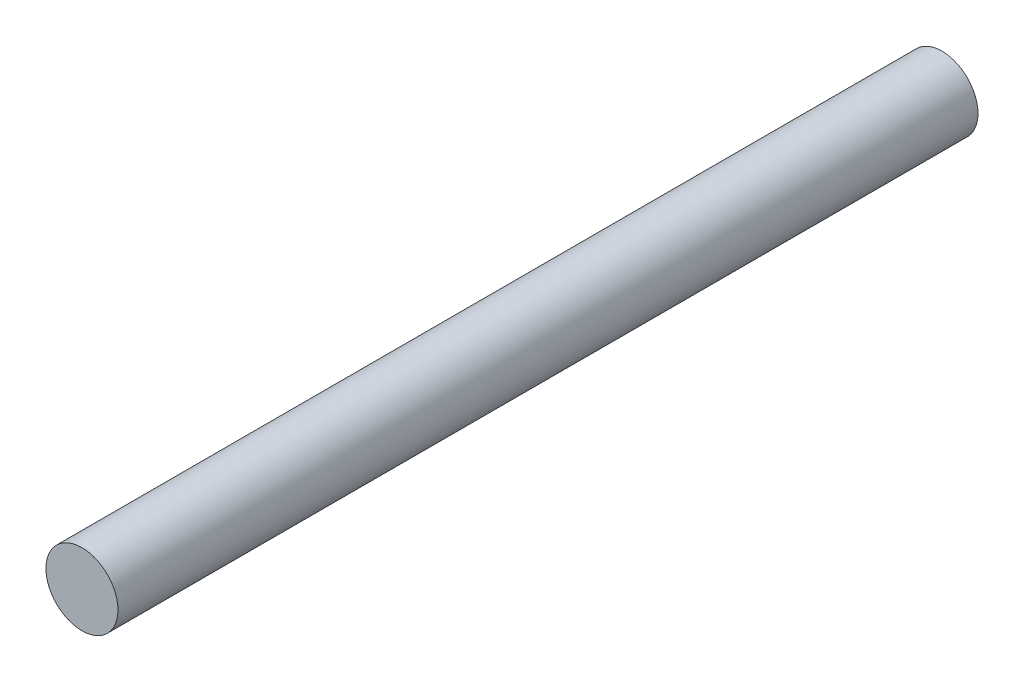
ISO-10303-21;
HEADER;
FILE_DESCRIPTION(('STEP AP214'),'2;1');
FILE_NAME('part.step','',(''),(''),'','','');
FILE_SCHEMA(('AUTOMOTIVE_DESIGN { 1 0 10303 214 1 1 1 1 }'));
ENDSEC;
DATA;
#1=APPLICATION_CONTEXT('core data for automotive mechanical design processes');
#2=APPLICATION_PROTOCOL_DEFINITION('international standard','automotive_design',2000,#1);
#3=PRODUCT_CONTEXT('',#1,'mechanical');
#4=PRODUCT('Part','Part','',(#3));
#5=PRODUCT_RELATED_PRODUCT_CATEGORY('part','',(#4));
#6=PRODUCT_DEFINITION_FORMATION('','',#4);
#7=PRODUCT_DEFINITION_CONTEXT('part definition',#1,'design');
#8=PRODUCT_DEFINITION('design','',#6,#7);
#9=PRODUCT_DEFINITION_SHAPE('','',#8);
#10=(LENGTH_UNIT() NAMED_UNIT(*) SI_UNIT(.MILLI.,.METRE.));
#11=(NAMED_UNIT(*) PLANE_ANGLE_UNIT() SI_UNIT($,.RADIAN.));
#12=(NAMED_UNIT(*) SI_UNIT($,.STERADIAN.) SOLID_ANGLE_UNIT());
#13=UNCERTAINTY_MEASURE_WITH_UNIT(LENGTH_MEASURE(1.E-05),#10,'distance_accuracy_value','');
#14=(GEOMETRIC_REPRESENTATION_CONTEXT(3) GLOBAL_UNCERTAINTY_ASSIGNED_CONTEXT((#13)) GLOBAL_UNIT_ASSIGNED_CONTEXT((#10,
#11,#12)) REPRESENTATION_CONTEXT('',''));
#15=CARTESIAN_POINT('',(0.,0.,0.));
#16=DIRECTION('',(0.,0.,1.));
#17=DIRECTION('',(1.,0.,0.));
#18=AXIS2_PLACEMENT_3D('',#15,#16,#17);
#19=CARTESIAN_POINT('',(0.,0.,0.));
#20=DIRECTION('',(0.,0.,1.));
#21=DIRECTION('',(1.,0.,0.));
#22=AXIS2_PLACEMENT_3D('',#19,#20,#21);
#23=CYLINDRICAL_SURFACE('',#22,4.);
#24=CARTESIAN_POINT('',(0.,0.,0.));
#25=DIRECTION('',(0.,0.,1.));
#26=DIRECTION('',(1.,0.,0.));
#27=AXIS2_PLACEMENT_3D('',#24,#25,#26);
#28=CIRCLE('',#27,4.);
#29=CARTESIAN_POINT('',(4.,0.,0.));
#30=VERTEX_POINT('',#29);
#31=EDGE_CURVE('E8',#30,#30,#28,.T.);
#32=ORIENTED_EDGE('',*,*,#31,.T.);
#33=EDGE_LOOP('',(#32));
#34=FACE_BOUND('',#33,.T.);
#35=CARTESIAN_POINT('',(0.,0.,95.5));
#36=DIRECTION('',(0.,0.,1.));
#37=DIRECTION('',(1.,0.,0.));
#38=AXIS2_PLACEMENT_3D('',#35,#36,#37);
#39=CIRCLE('',#38,4.);
#40=CARTESIAN_POINT('',(4.,0.,95.5));
#41=VERTEX_POINT('',#40);
#42=EDGE_CURVE('E18',#41,#41,#39,.T.);
#43=ORIENTED_EDGE('',*,*,#42,.F.);
#44=EDGE_LOOP('',(#43));
#45=FACE_BOUND('',#44,.T.);
#46=ADVANCED_FACE('F12',(#34,#45),#23,.T.);
#47=CARTESIAN_POINT('',(0.,0.,0.));
#48=DIRECTION('',(0.,0.,1.));
#49=DIRECTION('',(1.,0.,0.));
#50=AXIS2_PLACEMENT_3D('',#47,#48,#49);
#51=PLANE('',#50);
#52=ORIENTED_EDGE('',*,*,#31,.F.);
#53=EDGE_LOOP('',(#52));
#54=FACE_BOUND('',#53,.T.);
#55=ADVANCED_FACE('F27',(#54),#51,.F.);
#56=CARTESIAN_POINT('',(0.,0.,95.5));
#57=DIRECTION('',(0.,0.,1.));
#58=DIRECTION('',(1.,0.,0.));
#59=AXIS2_PLACEMENT_3D('',#56,#57,#58);
#60=PLANE('',#59);
#61=ORIENTED_EDGE('',*,*,#42,.T.);
#62=EDGE_LOOP('',(#61));
#63=FACE_BOUND('',#62,.T.);
#64=ADVANCED_FACE('F24',(#63),#60,.T.);
#65=CLOSED_SHELL('',(#46,#55,#64));
#66=MANIFOLD_SOLID_BREP('B1',#65);
#67=ADVANCED_BREP_SHAPE_REPRESENTATION('',(#18,#66),#14);
#68=SHAPE_DEFINITION_REPRESENTATION(#9,#67);
ENDSEC;
END-ISO-10303-21;
